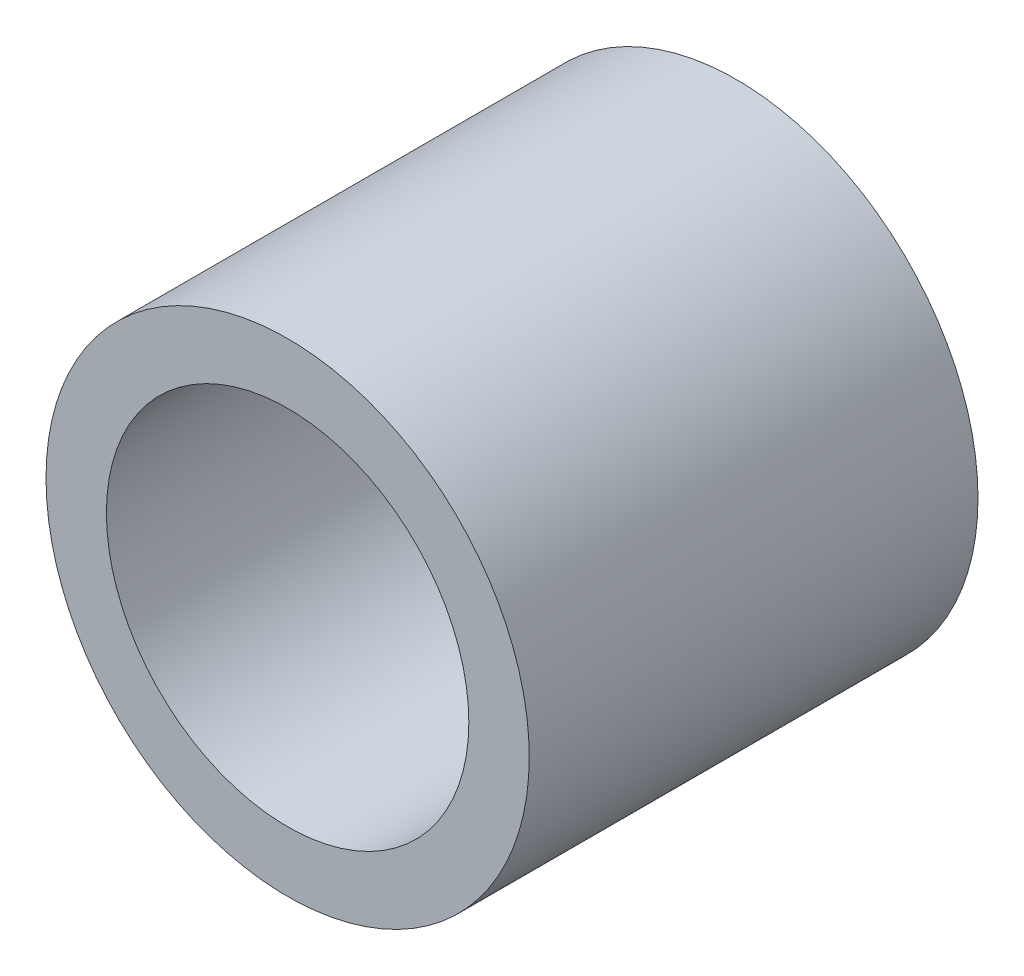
ISO-10303-21;
HEADER;
FILE_DESCRIPTION(('STEP AP214'),'2;1');
FILE_NAME('part.step','',(''),(''),'','','');
FILE_SCHEMA(('AUTOMOTIVE_DESIGN { 1 0 10303 214 1 1 1 1 }'));
ENDSEC;
DATA;
#1=APPLICATION_CONTEXT('core data for automotive mechanical design processes');
#2=APPLICATION_PROTOCOL_DEFINITION('international standard','automotive_design',2000,#1);
#3=PRODUCT_CONTEXT('',#1,'mechanical');
#4=PRODUCT('Part','Part','',(#3));
#5=PRODUCT_RELATED_PRODUCT_CATEGORY('part','',(#4));
#6=PRODUCT_DEFINITION_FORMATION('','',#4);
#7=PRODUCT_DEFINITION_CONTEXT('part definition',#1,'design');
#8=PRODUCT_DEFINITION('design','',#6,#7);
#9=PRODUCT_DEFINITION_SHAPE('','',#8);
#10=(LENGTH_UNIT() NAMED_UNIT(*) SI_UNIT(.MILLI.,.METRE.));
#11=(NAMED_UNIT(*) PLANE_ANGLE_UNIT() SI_UNIT($,.RADIAN.));
#12=(NAMED_UNIT(*) SI_UNIT($,.STERADIAN.) SOLID_ANGLE_UNIT());
#13=UNCERTAINTY_MEASURE_WITH_UNIT(LENGTH_MEASURE(1.E-05),#10,'distance_accuracy_value','');
#14=(GEOMETRIC_REPRESENTATION_CONTEXT(3) GLOBAL_UNCERTAINTY_ASSIGNED_CONTEXT((#13)) GLOBAL_UNIT_ASSIGNED_CONTEXT((#10,
#11,#12)) REPRESENTATION_CONTEXT('',''));
#15=CARTESIAN_POINT('',(0.,0.,0.));
#16=DIRECTION('',(0.,0.,1.));
#17=DIRECTION('',(1.,0.,0.));
#18=AXIS2_PLACEMENT_3D('',#15,#16,#17);
#19=CARTESIAN_POINT('',(0.,0.,13.));
#20=DIRECTION('',(0.,0.,1.));
#21=DIRECTION('',(1.,0.,0.));
#22=AXIS2_PLACEMENT_3D('',#19,#20,#21);
#23=PLANE('',#22);
#24=CARTESIAN_POINT('',(0.,0.,13.));
#25=DIRECTION('',(0.,0.,1.));
#26=DIRECTION('',(1.,0.,0.));
#27=AXIS2_PLACEMENT_3D('',#24,#25,#26);
#28=CIRCLE('',#27,7.);
#29=CARTESIAN_POINT('',(-7.,0.,13.));
#30=VERTEX_POINT('',#29);
#31=EDGE_CURVE('E12',#30,#30,#28,.T.);
#32=ORIENTED_EDGE('',*,*,#31,.T.);
#33=EDGE_LOOP('',(#32));
#34=FACE_BOUND('',#33,.T.);
#35=CARTESIAN_POINT('',(0.,0.,13.));
#36=DIRECTION('',(0.,0.,1.));
#37=DIRECTION('',(1.,0.,0.));
#38=AXIS2_PLACEMENT_3D('',#35,#36,#37);
#39=CIRCLE('',#38,5.25);
#40=CARTESIAN_POINT('',(-5.25,0.,13.));
#41=VERTEX_POINT('',#40);
#42=EDGE_CURVE('E51',#41,#41,#39,.T.);
#43=ORIENTED_EDGE('',*,*,#42,.F.);
#44=EDGE_LOOP('',(#43));
#45=FACE_BOUND('',#44,.T.);
#46=ADVANCED_FACE('F40',(#34,#45),#23,.T.);
#47=CARTESIAN_POINT('',(0.,0.,0.));
#48=DIRECTION('',(0.,0.,1.));
#49=DIRECTION('',(1.,0.,0.));
#50=AXIS2_PLACEMENT_3D('',#47,#48,#49);
#51=PLANE('',#50);
#52=CARTESIAN_POINT('',(0.,0.,0.));
#53=DIRECTION('',(0.,0.,1.));
#54=DIRECTION('',(1.,0.,0.));
#55=AXIS2_PLACEMENT_3D('',#52,#53,#54);
#56=CIRCLE('',#55,7.);
#57=CARTESIAN_POINT('',(-7.,0.,0.));
#58=VERTEX_POINT('',#57);
#59=EDGE_CURVE('E44',#58,#58,#56,.T.);
#60=ORIENTED_EDGE('',*,*,#59,.F.);
#61=EDGE_LOOP('',(#60));
#62=FACE_BOUND('',#61,.T.);
#63=CARTESIAN_POINT('',(0.,0.,0.));
#64=DIRECTION('',(0.,0.,1.));
#65=DIRECTION('',(1.,0.,0.));
#66=AXIS2_PLACEMENT_3D('',#63,#64,#65);
#67=CIRCLE('',#66,5.25);
#68=CARTESIAN_POINT('',(-5.25,0.,0.));
#69=VERTEX_POINT('',#68);
#70=EDGE_CURVE('E53',#69,#69,#67,.T.);
#71=ORIENTED_EDGE('',*,*,#70,.T.);
#72=EDGE_LOOP('',(#71));
#73=FACE_BOUND('',#72,.T.);
#74=ADVANCED_FACE('F63',(#62,#73),#51,.F.);
#75=CARTESIAN_POINT('',(0.,0.,13.));
#76=DIRECTION('',(0.,0.,-1.));
#77=DIRECTION('',(-1.,0.,0.));
#78=AXIS2_PLACEMENT_3D('',#75,#76,#77);
#79=CYLINDRICAL_SURFACE('',#78,7.);
#80=CARTESIAN_POINT('',(-7.,0.,13.));
#81=CARTESIAN_POINT('',(-7.,0.,12.8645833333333));
#82=CARTESIAN_POINT('',(-7.,0.,12.7291666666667));
#83=CARTESIAN_POINT('',(-7.,0.,12.4583333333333));
#84=CARTESIAN_POINT('',(-7.,0.,12.3229166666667));
#85=CARTESIAN_POINT('',(-7.,0.,12.0520833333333));
#86=CARTESIAN_POINT('',(-7.,0.,11.9166666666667));
#87=CARTESIAN_POINT('',(-7.,0.,11.6458333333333));
#88=CARTESIAN_POINT('',(-7.,0.,11.5104166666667));
#89=CARTESIAN_POINT('',(-7.,0.,11.2395833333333));
#90=CARTESIAN_POINT('',(-7.,0.,11.1041666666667));
#91=CARTESIAN_POINT('',(-7.,0.,10.8333333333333));
#92=CARTESIAN_POINT('',(-7.,0.,10.6979166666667));
#93=CARTESIAN_POINT('',(-7.,0.,10.4270833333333));
#94=CARTESIAN_POINT('',(-7.,0.,10.2916666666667));
#95=CARTESIAN_POINT('',(-7.,0.,10.0208333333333));
#96=CARTESIAN_POINT('',(-7.,0.,9.88541666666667));
#97=CARTESIAN_POINT('',(-7.,0.,9.61458333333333));
#98=CARTESIAN_POINT('',(-7.,0.,9.47916666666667));
#99=CARTESIAN_POINT('',(-7.,0.,9.20833333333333));
#100=CARTESIAN_POINT('',(-7.,0.,9.07291666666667));
#101=CARTESIAN_POINT('',(-7.,0.,8.80208333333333));
#102=CARTESIAN_POINT('',(-7.,0.,8.66666666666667));
#103=CARTESIAN_POINT('',(-7.,0.,8.39583333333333));
#104=CARTESIAN_POINT('',(-7.,0.,8.26041666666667));
#105=CARTESIAN_POINT('',(-7.,0.,7.98958333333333));
#106=CARTESIAN_POINT('',(-7.,0.,7.85416666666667));
#107=CARTESIAN_POINT('',(-7.,0.,7.58333333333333));
#108=CARTESIAN_POINT('',(-7.,0.,7.44791666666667));
#109=CARTESIAN_POINT('',(-7.,0.,7.17708333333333));
#110=CARTESIAN_POINT('',(-7.,0.,7.04166666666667));
#111=CARTESIAN_POINT('',(-7.,0.,6.77083333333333));
#112=CARTESIAN_POINT('',(-7.,0.,6.63541666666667));
#113=CARTESIAN_POINT('',(-7.,0.,6.36458333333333));
#114=CARTESIAN_POINT('',(-7.,0.,6.22916666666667));
#115=CARTESIAN_POINT('',(-7.,0.,5.95833333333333));
#116=CARTESIAN_POINT('',(-7.,0.,5.82291666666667));
#117=CARTESIAN_POINT('',(-7.,0.,5.55208333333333));
#118=CARTESIAN_POINT('',(-7.,0.,5.41666666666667));
#119=CARTESIAN_POINT('',(-7.,0.,5.14583333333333));
#120=CARTESIAN_POINT('',(-7.,0.,5.01041666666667));
#121=CARTESIAN_POINT('',(-7.,0.,4.73958333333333));
#122=CARTESIAN_POINT('',(-7.,0.,4.60416666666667));
#123=CARTESIAN_POINT('',(-7.,0.,4.33333333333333));
#124=CARTESIAN_POINT('',(-7.,0.,4.19791666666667));
#125=CARTESIAN_POINT('',(-7.,0.,3.92708333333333));
#126=CARTESIAN_POINT('',(-7.,0.,3.79166666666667));
#127=CARTESIAN_POINT('',(-7.,0.,3.52083333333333));
#128=CARTESIAN_POINT('',(-7.,0.,3.38541666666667));
#129=CARTESIAN_POINT('',(-7.,0.,3.11458333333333));
#130=CARTESIAN_POINT('',(-7.,0.,2.97916666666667));
#131=CARTESIAN_POINT('',(-7.,0.,2.70833333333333));
#132=CARTESIAN_POINT('',(-7.,0.,2.57291666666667));
#133=CARTESIAN_POINT('',(-7.,0.,2.30208333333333));
#134=CARTESIAN_POINT('',(-7.,0.,2.16666666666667));
#135=CARTESIAN_POINT('',(-7.,0.,1.89583333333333));
#136=CARTESIAN_POINT('',(-7.,0.,1.76041666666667));
#137=CARTESIAN_POINT('',(-7.,0.,1.48958333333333));
#138=CARTESIAN_POINT('',(-7.,0.,1.35416666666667));
#139=CARTESIAN_POINT('',(-7.,0.,1.08333333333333));
#140=CARTESIAN_POINT('',(-7.,0.,0.947916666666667));
#141=CARTESIAN_POINT('',(-7.,0.,0.677083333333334));
#142=CARTESIAN_POINT('',(-7.,0.,0.541666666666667));
#143=CARTESIAN_POINT('',(-7.,0.,0.270833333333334));
#144=CARTESIAN_POINT('',(-7.,0.,0.135416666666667));
#145=CARTESIAN_POINT('',(-7.,0.,0.));
#146=B_SPLINE_CURVE_WITH_KNOTS('',3,(#80,#81,#82,#83,#84,#85,#86,#87,#88,#89,#90,#91,#92,#93,
#94,#95,#96,#97,#98,#99,#100,#101,#102,#103,#104,#105,#106,#107,#108,#109,#110,#111,#112,#113,
#114,#115,#116,#117,#118,#119,#120,#121,#122,#123,#124,#125,#126,#127,#128,#129,#130,#131,#132,
#133,#134,#135,#136,#137,#138,#139,#140,#141,#142,#143,#144,#145),.UNSPECIFIED.,.F.,.F.,(4,2,2,
2,2,2,2,2,2,2,2,2,2,2,2,2,2,2,2,2,2,2,2,2,2,2,2,2,2,2,2,2,4),(0.,0.406249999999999,
0.812499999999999,1.21875,1.625,2.03125,2.4375,2.84375,3.25,3.65625,4.0625,4.46875,4.875,
5.28125,5.6875,6.09375,6.5,6.90625,7.3125,7.71875,8.125,8.53125,8.9375,9.34375,9.75,10.15625,
10.5625,10.96875,11.375,11.78125,12.1875,12.59375,13.),.UNSPECIFIED.);
#147=EDGE_CURVE('BSEAM42',#30,#58,#146,.T.);
#148=ORIENTED_EDGE('',*,*,#31,.F.);
#149=ORIENTED_EDGE('',*,*,#59,.T.);
#150=ORIENTED_EDGE('',*,*,#147,.T.);
#151=ORIENTED_EDGE('',*,*,#147,.F.);
#152=EDGE_LOOP('',(#148,#150,#149,#151));
#153=FACE_BOUND('',#152,.T.);
#154=ADVANCED_FACE('F42',(#153),#79,.T.);
#155=CARTESIAN_POINT('',(0.,0.,13.));
#156=DIRECTION('',(0.,0.,-1.));
#157=DIRECTION('',(-1.,0.,0.));
#158=AXIS2_PLACEMENT_3D('',#155,#156,#157);
#159=CYLINDRICAL_SURFACE('',#158,5.25);
#160=CARTESIAN_POINT('',(-5.25,0.,13.));
#161=CARTESIAN_POINT('',(-5.25,0.,12.8645833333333));
#162=CARTESIAN_POINT('',(-5.25,0.,12.7291666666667));
#163=CARTESIAN_POINT('',(-5.25,0.,12.4583333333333));
#164=CARTESIAN_POINT('',(-5.25,0.,12.3229166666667));
#165=CARTESIAN_POINT('',(-5.25,0.,12.0520833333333));
#166=CARTESIAN_POINT('',(-5.25,0.,11.9166666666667));
#167=CARTESIAN_POINT('',(-5.25,0.,11.6458333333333));
#168=CARTESIAN_POINT('',(-5.25,0.,11.5104166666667));
#169=CARTESIAN_POINT('',(-5.25,0.,11.2395833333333));
#170=CARTESIAN_POINT('',(-5.25,0.,11.1041666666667));
#171=CARTESIAN_POINT('',(-5.25,0.,10.8333333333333));
#172=CARTESIAN_POINT('',(-5.25,0.,10.6979166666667));
#173=CARTESIAN_POINT('',(-5.25,0.,10.4270833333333));
#174=CARTESIAN_POINT('',(-5.25,0.,10.2916666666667));
#175=CARTESIAN_POINT('',(-5.25,0.,10.0208333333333));
#176=CARTESIAN_POINT('',(-5.25,0.,9.88541666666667));
#177=CARTESIAN_POINT('',(-5.25,0.,9.61458333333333));
#178=CARTESIAN_POINT('',(-5.25,0.,9.47916666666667));
#179=CARTESIAN_POINT('',(-5.25,0.,9.20833333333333));
#180=CARTESIAN_POINT('',(-5.25,0.,9.07291666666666));
#181=CARTESIAN_POINT('',(-5.25,0.,8.80208333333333));
#182=CARTESIAN_POINT('',(-5.25,0.,8.66666666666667));
#183=CARTESIAN_POINT('',(-5.25,0.,8.39583333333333));
#184=CARTESIAN_POINT('',(-5.25,0.,8.26041666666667));
#185=CARTESIAN_POINT('',(-5.25,0.,7.98958333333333));
#186=CARTESIAN_POINT('',(-5.25,0.,7.85416666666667));
#187=CARTESIAN_POINT('',(-5.25,0.,7.58333333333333));
#188=CARTESIAN_POINT('',(-5.25,0.,7.44791666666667));
#189=CARTESIAN_POINT('',(-5.25,0.,7.17708333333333));
#190=CARTESIAN_POINT('',(-5.25,0.,7.04166666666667));
#191=CARTESIAN_POINT('',(-5.25,0.,6.77083333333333));
#192=CARTESIAN_POINT('',(-5.25,0.,6.63541666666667));
#193=CARTESIAN_POINT('',(-5.25,0.,6.36458333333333));
#194=CARTESIAN_POINT('',(-5.25,0.,6.22916666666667));
#195=CARTESIAN_POINT('',(-5.25,0.,5.95833333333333));
#196=CARTESIAN_POINT('',(-5.25,0.,5.82291666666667));
#197=CARTESIAN_POINT('',(-5.25,0.,5.55208333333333));
#198=CARTESIAN_POINT('',(-5.25,0.,5.41666666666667));
#199=CARTESIAN_POINT('',(-5.25,0.,5.14583333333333));
#200=CARTESIAN_POINT('',(-5.25,0.,5.01041666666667));
#201=CARTESIAN_POINT('',(-5.25,0.,4.73958333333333));
#202=CARTESIAN_POINT('',(-5.25,0.,4.60416666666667));
#203=CARTESIAN_POINT('',(-5.25,0.,4.33333333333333));
#204=CARTESIAN_POINT('',(-5.25,0.,4.19791666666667));
#205=CARTESIAN_POINT('',(-5.25,0.,3.92708333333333));
#206=CARTESIAN_POINT('',(-5.25,0.,3.79166666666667));
#207=CARTESIAN_POINT('',(-5.25,0.,3.52083333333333));
#208=CARTESIAN_POINT('',(-5.25,0.,3.38541666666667));
#209=CARTESIAN_POINT('',(-5.25,0.,3.11458333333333));
#210=CARTESIAN_POINT('',(-5.25,0.,2.97916666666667));
#211=CARTESIAN_POINT('',(-5.25,0.,2.70833333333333));
#212=CARTESIAN_POINT('',(-5.25,0.,2.57291666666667));
#213=CARTESIAN_POINT('',(-5.25,0.,2.30208333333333));
#214=CARTESIAN_POINT('',(-5.25,0.,2.16666666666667));
#215=CARTESIAN_POINT('',(-5.25,0.,1.89583333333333));
#216=CARTESIAN_POINT('',(-5.25,0.,1.76041666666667));
#217=CARTESIAN_POINT('',(-5.25,0.,1.48958333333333));
#218=CARTESIAN_POINT('',(-5.25,0.,1.35416666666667));
#219=CARTESIAN_POINT('',(-5.25,0.,1.08333333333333));
#220=CARTESIAN_POINT('',(-5.25,0.,0.947916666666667));
#221=CARTESIAN_POINT('',(-5.25,0.,0.677083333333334));
#222=CARTESIAN_POINT('',(-5.25,0.,0.541666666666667));
#223=CARTESIAN_POINT('',(-5.25,0.,0.270833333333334));
#224=CARTESIAN_POINT('',(-5.25,0.,0.135416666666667));
#225=CARTESIAN_POINT('',(-5.25,0.,0.));
#226=B_SPLINE_CURVE_WITH_KNOTS('',3,(#160,#161,#162,#163,#164,#165,#166,#167,#168,#169,#170,
#171,#172,#173,#174,#175,#176,#177,#178,#179,#180,#181,#182,#183,#184,#185,#186,#187,#188,#189,
#190,#191,#192,#193,#194,#195,#196,#197,#198,#199,#200,#201,#202,#203,#204,#205,#206,#207,#208,
#209,#210,#211,#212,#213,#214,#215,#216,#217,#218,#219,#220,#221,#222,#223,#224,#225),
.UNSPECIFIED.,.F.,.F.,(4,2,2,2,2,2,2,2,2,2,2,2,2,2,2,2,2,2,2,2,2,2,2,2,2,2,2,2,2,2,2,2,4),(0.,
0.40625,0.812500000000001,1.21875,1.625,2.03125,2.4375,2.84375,3.25,3.65625,4.0625,4.46875,
4.875,5.28125,5.6875,6.09375,6.5,6.90625,7.3125,7.71875,8.125,8.53125,8.9375,9.34375,9.75,
10.15625,10.5625,10.96875,11.375,11.78125,12.1875,12.59375,13.),.UNSPECIFIED.);
#227=EDGE_CURVE('BSEAM59',#41,#69,#226,.T.);
#228=ORIENTED_EDGE('',*,*,#42,.T.);
#229=ORIENTED_EDGE('',*,*,#70,.F.);
#230=ORIENTED_EDGE('',*,*,#227,.T.);
#231=ORIENTED_EDGE('',*,*,#227,.F.);
#232=EDGE_LOOP('',(#228,#230,#229,#231));
#233=FACE_BOUND('',#232,.T.);
#234=ADVANCED_FACE('F59',(#233),#159,.F.);
#235=CLOSED_SHELL('',(#46,#74,#154,#234));
#236=MANIFOLD_SOLID_BREP('B2',#235);
#237=ADVANCED_BREP_SHAPE_REPRESENTATION('',(#18,#236),#14);
#238=SHAPE_DEFINITION_REPRESENTATION(#9,#237);
ENDSEC;
END-ISO-10303-21;
